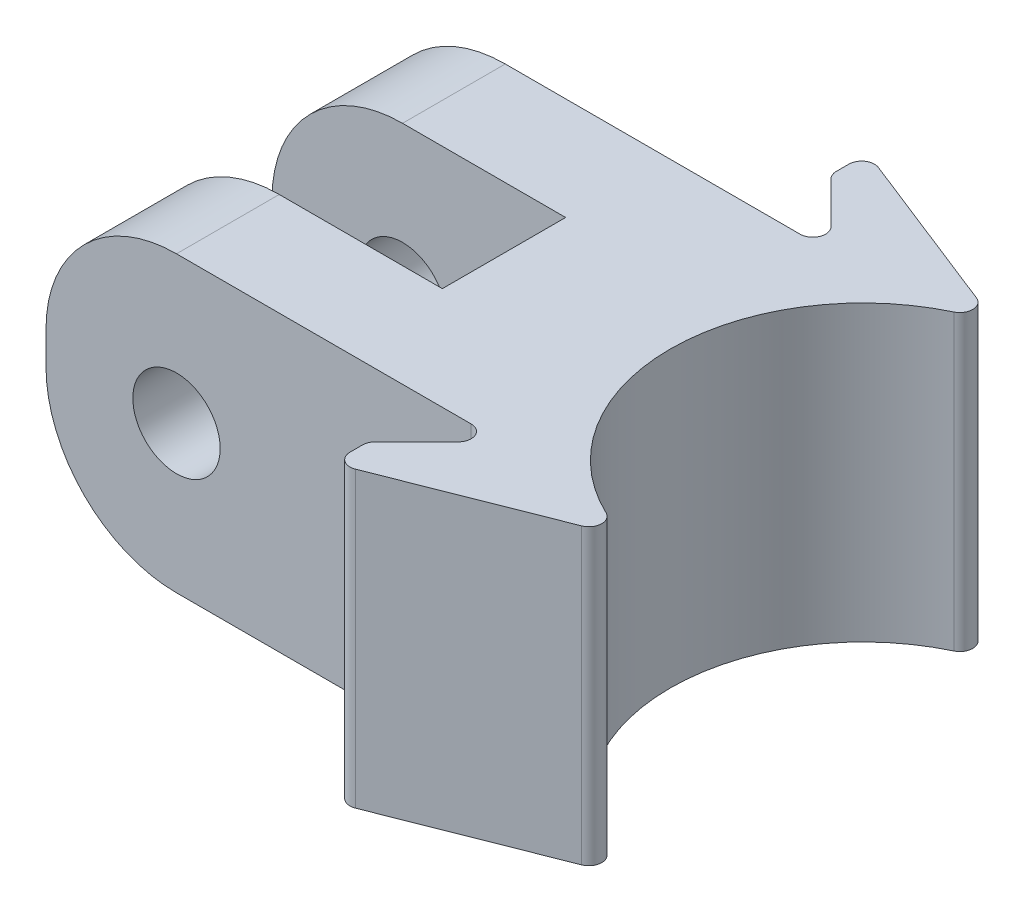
ISO-10303-21;
HEADER;
FILE_DESCRIPTION(('STEP AP214'),'2;1');
FILE_NAME('part.step','',(''),(''),'','','');
FILE_SCHEMA(('AUTOMOTIVE_DESIGN { 1 0 10303 214 1 1 1 1 }'));
ENDSEC;
DATA;
#1=APPLICATION_CONTEXT('core data for automotive mechanical design processes');
#2=APPLICATION_PROTOCOL_DEFINITION('international standard','automotive_design',2000,#1);
#3=PRODUCT_CONTEXT('',#1,'mechanical');
#4=PRODUCT('Part','Part','',(#3));
#5=PRODUCT_RELATED_PRODUCT_CATEGORY('part','',(#4));
#6=PRODUCT_DEFINITION_FORMATION('','',#4);
#7=PRODUCT_DEFINITION_CONTEXT('part definition',#1,'design');
#8=PRODUCT_DEFINITION('design','',#6,#7);
#9=PRODUCT_DEFINITION_SHAPE('','',#8);
#10=(LENGTH_UNIT() NAMED_UNIT(*) SI_UNIT(.MILLI.,.METRE.));
#11=(NAMED_UNIT(*) PLANE_ANGLE_UNIT() SI_UNIT($,.RADIAN.));
#12=(NAMED_UNIT(*) SI_UNIT($,.STERADIAN.) SOLID_ANGLE_UNIT());
#13=UNCERTAINTY_MEASURE_WITH_UNIT(LENGTH_MEASURE(1.E-05),#10,'distance_accuracy_value','');
#14=(GEOMETRIC_REPRESENTATION_CONTEXT(3) GLOBAL_UNCERTAINTY_ASSIGNED_CONTEXT((#13)) GLOBAL_UNIT_ASSIGNED_CONTEXT((#10,
#11,#12)) REPRESENTATION_CONTEXT('',''));
#15=CARTESIAN_POINT('',(0.,0.,0.));
#16=DIRECTION('',(0.,0.,1.));
#17=DIRECTION('',(1.,0.,0.));
#18=AXIS2_PLACEMENT_3D('',#15,#16,#17);
#19=CARTESIAN_POINT('',(-11.43,11.43,-2.4));
#20=DIRECTION('',(1.,0.,0.));
#21=DIRECTION('',(0.,0.,-1.));
#22=AXIS2_PLACEMENT_3D('',#19,#20,#21);
#23=PLANE('',#22);
#24=DIRECTION('',(0.,-1.,0.));
#25=VECTOR('',#24,1.);
#26=CARTESIAN_POINT('',(-11.43,11.43,-6.4));
#27=LINE('',#26,#25);
#28=CARTESIAN_POINT('',(-11.43,6.35,-6.4));
#29=VERTEX_POINT('',#28);
#30=CARTESIAN_POINT('',(-11.43,5.08,-6.4));
#31=VERTEX_POINT('',#30);
#32=EDGE_CURVE('E261',#29,#31,#27,.T.);
#33=ORIENTED_EDGE('',*,*,#32,.T.);
#34=DIRECTION('',(0.,0.,1.));
#35=VECTOR('',#34,1.);
#36=CARTESIAN_POINT('',(-11.43,5.08,-2.4));
#37=LINE('',#36,#35);
#38=CARTESIAN_POINT('',(-11.43,5.08,-2.4));
#39=VERTEX_POINT('',#38);
#40=EDGE_CURVE('E320',#31,#39,#37,.T.);
#41=ORIENTED_EDGE('',*,*,#40,.T.);
#42=DIRECTION('',(0.,-1.,0.));
#43=VECTOR('',#42,1.);
#44=CARTESIAN_POINT('',(-11.43,11.43,-2.4));
#45=LINE('',#44,#43);
#46=CARTESIAN_POINT('',(-11.43,6.35,-2.4));
#47=VERTEX_POINT('',#46);
#48=EDGE_CURVE('E228',#47,#39,#45,.T.);
#49=ORIENTED_EDGE('',*,*,#48,.F.);
#50=DIRECTION('',(0.,0.,1.));
#51=VECTOR('',#50,1.);
#52=CARTESIAN_POINT('',(-11.43,6.35,-2.4));
#53=LINE('',#52,#51);
#54=EDGE_CURVE('E318',#47,#29,#53,.F.);
#55=ORIENTED_EDGE('',*,*,#54,.T.);
#56=EDGE_LOOP('',(#33,#41,#49,#55));
#57=FACE_BOUND('',#56,.T.);
#58=ADVANCED_FACE('F33',(#57),#23,.F.);
#59=CARTESIAN_POINT('',(-11.43,11.43,-2.4));
#60=DIRECTION('',(0.,0.,-1.));
#61=DIRECTION('',(-1.,0.,0.));
#62=AXIS2_PLACEMENT_3D('',#59,#60,#61);
#63=PLANE('',#62);
#64=CARTESIAN_POINT('',(-6.35,5.715,-2.4));
#65=DIRECTION('',(0.,0.,-1.));
#66=DIRECTION('',(-1.,0.,0.));
#67=AXIS2_PLACEMENT_3D('',#64,#65,#66);
#68=CIRCLE('',#67,1.69999999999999);
#69=CARTESIAN_POINT('',(-8.04999999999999,5.715,-2.4));
#70=VERTEX_POINT('',#69);
#71=EDGE_CURVE('E264',#70,#70,#68,.T.);
#72=ORIENTED_EDGE('',*,*,#71,.T.);
#73=EDGE_LOOP('',(#72));
#74=FACE_BOUND('',#73,.T.);
#75=ORIENTED_EDGE('',*,*,#48,.T.);
#76=CARTESIAN_POINT('',(-6.35,5.08,-2.4));
#77=DIRECTION('',(0.,0.,-1.));
#78=DIRECTION('',(-1.,0.,0.));
#79=AXIS2_PLACEMENT_3D('',#76,#77,#78);
#80=CIRCLE('',#79,5.08);
#81=CARTESIAN_POINT('',(-6.35,0.,-2.4));
#82=VERTEX_POINT('',#81);
#83=EDGE_CURVE('E325',#39,#82,#80,.F.);
#84=ORIENTED_EDGE('',*,*,#83,.T.);
#85=DIRECTION('',(1.,0.,0.));
#86=VECTOR('',#85,1.);
#87=CARTESIAN_POINT('',(-11.43,0.,-2.4));
#88=LINE('',#87,#86);
#89=CARTESIAN_POINT('',(0.,0.,-2.4));
#90=VERTEX_POINT('',#89);
#91=EDGE_CURVE('E225',#82,#90,#88,.T.);
#92=ORIENTED_EDGE('',*,*,#91,.T.);
#93=DIRECTION('',(0.,-1.,0.));
#94=VECTOR('',#93,1.);
#95=CARTESIAN_POINT('',(0.,11.43,-2.4));
#96=LINE('',#95,#94);
#97=CARTESIAN_POINT('',(0.,11.43,-2.4));
#98=VERTEX_POINT('',#97);
#99=EDGE_CURVE('E221',#98,#90,#96,.T.);
#100=ORIENTED_EDGE('',*,*,#99,.F.);
#101=DIRECTION('',(1.,0.,0.));
#102=VECTOR('',#101,1.);
#103=CARTESIAN_POINT('',(-11.43,11.43,-2.4));
#104=LINE('',#103,#102);
#105=CARTESIAN_POINT('',(-6.35,11.43,-2.4));
#106=VERTEX_POINT('',#105);
#107=EDGE_CURVE('E207',#106,#98,#104,.T.);
#108=ORIENTED_EDGE('',*,*,#107,.F.);
#109=CARTESIAN_POINT('',(-6.35,6.35,-2.4));
#110=DIRECTION('',(0.,0.,-1.));
#111=DIRECTION('',(-1.,0.,0.));
#112=AXIS2_PLACEMENT_3D('',#109,#110,#111);
#113=CIRCLE('',#112,5.08);
#114=EDGE_CURVE('E323',#106,#47,#113,.F.);
#115=ORIENTED_EDGE('',*,*,#114,.T.);
#116=EDGE_LOOP('',(#75,#84,#92,#100,#108,#115));
#117=FACE_BOUND('',#116,.T.);
#118=ADVANCED_FACE('F223',(#74,#117),#63,.F.);
#119=CARTESIAN_POINT('',(0.,11.43,-2.4));
#120=DIRECTION('',(1.,0.,0.));
#121=DIRECTION('',(0.,0.,-1.));
#122=AXIS2_PLACEMENT_3D('',#119,#120,#121);
#123=PLANE('',#122);
#124=DIRECTION('',(0.,0.,1.));
#125=VECTOR('',#124,1.);
#126=CARTESIAN_POINT('',(0.,0.,-2.4));
#127=LINE('',#126,#125);
#128=CARTESIAN_POINT('',(0.,0.,2.4));
#129=VERTEX_POINT('',#128);
#130=EDGE_CURVE('E263',#90,#129,#127,.T.);
#131=ORIENTED_EDGE('',*,*,#130,.T.);
#132=DIRECTION('',(0.,-1.,0.));
#133=VECTOR('',#132,1.);
#134=CARTESIAN_POINT('',(0.,11.43,2.4));
#135=LINE('',#134,#133);
#136=CARTESIAN_POINT('',(0.,11.43,2.4));
#137=VERTEX_POINT('',#136);
#138=EDGE_CURVE('E229',#137,#129,#135,.T.);
#139=ORIENTED_EDGE('',*,*,#138,.F.);
#140=DIRECTION('',(0.,0.,1.));
#141=VECTOR('',#140,1.);
#142=CARTESIAN_POINT('',(0.,11.43,-2.4));
#143=LINE('',#142,#141);
#144=EDGE_CURVE('E213',#98,#137,#143,.T.);
#145=ORIENTED_EDGE('',*,*,#144,.F.);
#146=ORIENTED_EDGE('',*,*,#99,.T.);
#147=EDGE_LOOP('',(#131,#139,#145,#146));
#148=FACE_BOUND('',#147,.T.);
#149=ADVANCED_FACE('F231',(#148),#123,.F.);
#150=CARTESIAN_POINT('',(0.,11.43,2.4));
#151=DIRECTION('',(0.,0.,1.));
#152=DIRECTION('',(1.,0.,0.));
#153=AXIS2_PLACEMENT_3D('',#150,#151,#152);
#154=PLANE('',#153);
#155=CARTESIAN_POINT('',(-6.35,5.715,2.4));
#156=DIRECTION('',(0.,0.,1.));
#157=DIRECTION('',(1.,0.,0.));
#158=AXIS2_PLACEMENT_3D('',#155,#156,#157);
#159=CIRCLE('',#158,1.69999999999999);
#160=CARTESIAN_POINT('',(-4.65000000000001,5.715,2.4));
#161=VERTEX_POINT('',#160);
#162=EDGE_CURVE('E498',#161,#161,#159,.T.);
#163=ORIENTED_EDGE('',*,*,#162,.T.);
#164=EDGE_LOOP('',(#163));
#165=FACE_BOUND('',#164,.T.);
#166=DIRECTION('',(-1.,0.,0.));
#167=VECTOR('',#166,1.);
#168=CARTESIAN_POINT('',(0.,0.,2.4));
#169=LINE('',#168,#167);
#170=CARTESIAN_POINT('',(-6.35,0.,2.4));
#171=VERTEX_POINT('',#170);
#172=EDGE_CURVE('E266',#129,#171,#169,.T.);
#173=ORIENTED_EDGE('',*,*,#172,.T.);
#174=CARTESIAN_POINT('',(-6.35,5.08,2.4));
#175=DIRECTION('',(0.,0.,1.));
#176=DIRECTION('',(1.,0.,0.));
#177=AXIS2_PLACEMENT_3D('',#174,#175,#176);
#178=CIRCLE('',#177,5.08);
#179=CARTESIAN_POINT('',(-11.43,5.08,2.4));
#180=VERTEX_POINT('',#179);
#181=EDGE_CURVE('E316',#171,#180,#178,.F.);
#182=ORIENTED_EDGE('',*,*,#181,.T.);
#183=DIRECTION('',(0.,-1.,0.));
#184=VECTOR('',#183,1.);
#185=CARTESIAN_POINT('',(-11.43,11.43,2.4));
#186=LINE('',#185,#184);
#187=CARTESIAN_POINT('',(-11.43,6.35,2.4));
#188=VERTEX_POINT('',#187);
#189=EDGE_CURVE('E295',#188,#180,#186,.T.);
#190=ORIENTED_EDGE('',*,*,#189,.F.);
#191=CARTESIAN_POINT('',(-6.35,6.35,2.4));
#192=DIRECTION('',(0.,0.,1.));
#193=DIRECTION('',(1.,0.,0.));
#194=AXIS2_PLACEMENT_3D('',#191,#192,#193);
#195=CIRCLE('',#194,5.08);
#196=CARTESIAN_POINT('',(-6.35,11.43,2.4));
#197=VERTEX_POINT('',#196);
#198=EDGE_CURVE('E314',#188,#197,#195,.F.);
#199=ORIENTED_EDGE('',*,*,#198,.T.);
#200=DIRECTION('',(-1.,0.,0.));
#201=VECTOR('',#200,1.);
#202=CARTESIAN_POINT('',(0.,11.43,2.4));
#203=LINE('',#202,#201);
#204=EDGE_CURVE('E234',#137,#197,#203,.T.);
#205=ORIENTED_EDGE('',*,*,#204,.F.);
#206=ORIENTED_EDGE('',*,*,#138,.T.);
#207=EDGE_LOOP('',(#173,#182,#190,#199,#205,#206));
#208=FACE_BOUND('',#207,.T.);
#209=ADVANCED_FACE('F430',(#165,#208),#154,.F.);
#210=CARTESIAN_POINT('',(-11.43,11.43,6.4));
#211=DIRECTION('',(1.,0.,0.));
#212=DIRECTION('',(0.,0.,-1.));
#213=AXIS2_PLACEMENT_3D('',#210,#211,#212);
#214=PLANE('',#213);
#215=ORIENTED_EDGE('',*,*,#189,.T.);
#216=DIRECTION('',(0.,0.,1.));
#217=VECTOR('',#216,1.);
#218=CARTESIAN_POINT('',(-11.43,5.08,6.4));
#219=LINE('',#218,#217);
#220=CARTESIAN_POINT('',(-11.43,5.08,6.4));
#221=VERTEX_POINT('',#220);
#222=EDGE_CURVE('E302',#180,#221,#219,.T.);
#223=ORIENTED_EDGE('',*,*,#222,.T.);
#224=DIRECTION('',(0.,-1.,0.));
#225=VECTOR('',#224,1.);
#226=CARTESIAN_POINT('',(-11.43,11.43,6.4));
#227=LINE('',#226,#225);
#228=CARTESIAN_POINT('',(-11.43,6.35,6.4));
#229=VERTEX_POINT('',#228);
#230=EDGE_CURVE('E292',#229,#221,#227,.T.);
#231=ORIENTED_EDGE('',*,*,#230,.F.);
#232=DIRECTION('',(0.,0.,1.));
#233=VECTOR('',#232,1.);
#234=CARTESIAN_POINT('',(-11.43,6.35,6.4));
#235=LINE('',#234,#233);
#236=EDGE_CURVE('E300',#229,#188,#235,.F.);
#237=ORIENTED_EDGE('',*,*,#236,.T.);
#238=EDGE_LOOP('',(#215,#223,#231,#237));
#239=FACE_BOUND('',#238,.T.);
#240=ADVANCED_FACE('F443',(#239),#214,.F.);
#241=CARTESIAN_POINT('',(6.32987145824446,11.43,6.4));
#242=DIRECTION('',(0.,0.,-1.));
#243=DIRECTION('',(-1.,0.,0.));
#244=AXIS2_PLACEMENT_3D('',#241,#242,#243);
#245=PLANE('',#244);
#246=CARTESIAN_POINT('',(-6.35,5.715,6.4));
#247=DIRECTION('',(0.,0.,1.));
#248=DIRECTION('',(1.,0.,0.));
#249=AXIS2_PLACEMENT_3D('',#246,#247,#248);
#250=CIRCLE('',#249,1.69999999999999);
#251=CARTESIAN_POINT('',(-4.65000000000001,5.715,6.4));
#252=VERTEX_POINT('',#251);
#253=EDGE_CURVE('E486',#252,#252,#250,.T.);
#254=ORIENTED_EDGE('',*,*,#253,.F.);
#255=EDGE_LOOP('',(#254));
#256=FACE_BOUND('',#255,.T.);
#257=DIRECTION('',(1.,0.,0.));
#258=VECTOR('',#257,1.);
#259=CARTESIAN_POINT('',(6.32987145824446,0.,6.4));
#260=LINE('',#259,#258);
#261=CARTESIAN_POINT('',(-6.35,0.,6.4));
#262=VERTEX_POINT('',#261);
#263=CARTESIAN_POINT('',(5.12276467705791,0.,6.4));
#264=VERTEX_POINT('',#263);
#265=EDGE_CURVE('E269',#262,#264,#260,.T.);
#266=ORIENTED_EDGE('',*,*,#265,.T.);
#267=DIRECTION('',(0.,-1.,0.));
#268=VECTOR('',#267,1.);
#269=CARTESIAN_POINT('',(5.12276467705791,11.43,6.4));
#270=LINE('',#269,#268);
#271=CARTESIAN_POINT('',(5.12276467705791,11.43,6.4));
#272=VERTEX_POINT('',#271);
#273=EDGE_CURVE('E382',#264,#272,#270,.F.);
#274=ORIENTED_EDGE('',*,*,#273,.T.);
#275=DIRECTION('',(1.,0.,0.));
#276=VECTOR('',#275,1.);
#277=CARTESIAN_POINT('',(6.32987145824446,11.43,6.4));
#278=LINE('',#277,#276);
#279=CARTESIAN_POINT('',(-6.35,11.43,6.4));
#280=VERTEX_POINT('',#279);
#281=EDGE_CURVE('E236',#280,#272,#278,.T.);
#282=ORIENTED_EDGE('',*,*,#281,.F.);
#283=CARTESIAN_POINT('',(-6.35,6.35,6.4));
#284=DIRECTION('',(0.,0.,-1.));
#285=DIRECTION('',(-1.,0.,0.));
#286=AXIS2_PLACEMENT_3D('',#283,#284,#285);
#287=CIRCLE('',#286,5.08);
#288=EDGE_CURVE('E305',#280,#229,#287,.F.);
#289=ORIENTED_EDGE('',*,*,#288,.T.);
#290=ORIENTED_EDGE('',*,*,#230,.T.);
#291=CARTESIAN_POINT('',(-6.35,5.08,6.4));
#292=DIRECTION('',(0.,0.,-1.));
#293=DIRECTION('',(-1.,0.,0.));
#294=AXIS2_PLACEMENT_3D('',#291,#292,#293);
#295=CIRCLE('',#294,5.08);
#296=EDGE_CURVE('E307',#221,#262,#295,.F.);
#297=ORIENTED_EDGE('',*,*,#296,.T.);
#298=EDGE_LOOP('',(#266,#274,#282,#289,#290,#297));
#299=FACE_BOUND('',#298,.T.);
#300=ADVANCED_FACE('F441',(#256,#299),#245,.F.);
#301=CARTESIAN_POINT('',(6.32987145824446,11.43,6.4));
#302=DIRECTION('',(0.707106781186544,0.,0.707106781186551));
#303=DIRECTION('',(0.707106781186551,0.,-0.707106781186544));
#304=AXIS2_PLACEMENT_3D('',#301,#302,#303);
#305=PLANE('',#304);
#306=DIRECTION('',(-0.707106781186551,0.,0.707106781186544));
#307=VECTOR('',#306,1.);
#308=CARTESIAN_POINT('',(6.32987145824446,0.,6.4));
#309=LINE('',#308,#307);
#310=CARTESIAN_POINT('',(5.47631806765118,0.,7.25355339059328));
#311=VERTEX_POINT('',#310);
#312=CARTESIAN_POINT('',(3.86124835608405,0.,8.86862310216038));
#313=VERTEX_POINT('',#312);
#314=EDGE_CURVE('E272',#311,#313,#309,.T.);
#315=ORIENTED_EDGE('',*,*,#314,.T.);
#316=DIRECTION('',(0.,-1.,0.));
#317=VECTOR('',#316,1.);
#318=CARTESIAN_POINT('',(3.86124835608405,11.43,8.86862310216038));
#319=LINE('',#318,#317);
#320=CARTESIAN_POINT('',(3.86124835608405,11.43,8.86862310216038));
#321=VERTEX_POINT('',#320);
#322=EDGE_CURVE('E380',#313,#321,#319,.F.);
#323=ORIENTED_EDGE('',*,*,#322,.T.);
#324=DIRECTION('',(-0.707106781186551,0.,0.707106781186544));
#325=VECTOR('',#324,1.);
#326=CARTESIAN_POINT('',(6.32987145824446,11.43,6.4));
#327=LINE('',#326,#325);
#328=CARTESIAN_POINT('',(5.47631806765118,11.43,7.25355339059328));
#329=VERTEX_POINT('',#328);
#330=EDGE_CURVE('E242',#329,#321,#327,.T.);
#331=ORIENTED_EDGE('',*,*,#330,.F.);
#332=DIRECTION('',(0.,-1.,0.));
#333=VECTOR('',#332,1.);
#334=CARTESIAN_POINT('',(5.47631806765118,0.,7.25355339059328));
#335=LINE('',#334,#333);
#336=EDGE_CURVE('E377',#329,#311,#335,.T.);
#337=ORIENTED_EDGE('',*,*,#336,.T.);
#338=EDGE_LOOP('',(#315,#323,#331,#337));
#339=FACE_BOUND('',#338,.T.);
#340=ADVANCED_FACE('F457',(#339),#305,.F.);
#341=CARTESIAN_POINT('',(3.71480174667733,11.43,9.01506971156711));
#342=DIRECTION('',(1.,0.,0.));
#343=DIRECTION('',(0.,0.,-1.));
#344=AXIS2_PLACEMENT_3D('',#341,#342,#343);
#345=PLANE('',#344);
#346=DIRECTION('',(0.,0.,1.));
#347=VECTOR('',#346,1.);
#348=CARTESIAN_POINT('',(3.71480174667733,0.,9.01506971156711));
#349=LINE('',#348,#347);
#350=CARTESIAN_POINT('',(3.71480174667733,0.,9.22217649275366));
#351=VERTEX_POINT('',#350);
#352=CARTESIAN_POINT('',(3.71480174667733,0.,9.70940074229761));
#353=VERTEX_POINT('',#352);
#354=EDGE_CURVE('E275',#351,#353,#349,.T.);
#355=ORIENTED_EDGE('',*,*,#354,.T.);
#356=DIRECTION('',(0.,-1.,0.));
#357=VECTOR('',#356,1.);
#358=CARTESIAN_POINT('',(3.71480174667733,11.43,9.70940074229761));
#359=LINE('',#358,#357);
#360=CARTESIAN_POINT('',(3.71480174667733,11.43,9.70940074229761));
#361=VERTEX_POINT('',#360);
#362=EDGE_CURVE('E375',#353,#361,#359,.F.);
#363=ORIENTED_EDGE('',*,*,#362,.T.);
#364=DIRECTION('',(0.,0.,1.));
#365=VECTOR('',#364,1.);
#366=CARTESIAN_POINT('',(3.71480174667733,11.43,9.01506971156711));
#367=LINE('',#366,#365);
#368=CARTESIAN_POINT('',(3.71480174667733,11.43,9.22217649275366));
#369=VERTEX_POINT('',#368);
#370=EDGE_CURVE('E245',#369,#361,#367,.T.);
#371=ORIENTED_EDGE('',*,*,#370,.F.);
#372=DIRECTION('',(0.,-1.,0.));
#373=VECTOR('',#372,1.);
#374=CARTESIAN_POINT('',(3.71480174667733,11.43,9.22217649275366));
#375=LINE('',#374,#373);
#376=EDGE_CURVE('E372',#369,#351,#375,.T.);
#377=ORIENTED_EDGE('',*,*,#376,.T.);
#378=EDGE_LOOP('',(#355,#363,#371,#377));
#379=FACE_BOUND('',#378,.T.);
#380=ADVANCED_FACE('F466',(#379),#345,.F.);
#381=CARTESIAN_POINT('',(3.71480174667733,11.43,10.4440431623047));
#382=DIRECTION('',(-0.366847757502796,0.,-0.930280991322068));
#383=DIRECTION('',(-0.930280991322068,0.,0.366847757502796));
#384=AXIS2_PLACEMENT_3D('',#381,#382,#383);
#385=PLANE('',#384);
#386=DIRECTION('',(0.930280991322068,0.,-0.366847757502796));
#387=VECTOR('',#386,1.);
#388=CARTESIAN_POINT('',(3.71480174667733,0.,10.4440431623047));
#389=LINE('',#388,#387);
#390=CARTESIAN_POINT('',(4.39822562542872,0.,10.1745412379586));
#391=VERTEX_POINT('',#390);
#392=CARTESIAN_POINT('',(10.7093241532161,0.,7.68581754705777));
#393=VERTEX_POINT('',#392);
#394=EDGE_CURVE('E278',#391,#393,#389,.T.);
#395=ORIENTED_EDGE('',*,*,#394,.T.);
#396=DIRECTION('',(0.,1.,0.));
#397=VECTOR('',#396,1.);
#398=CARTESIAN_POINT('',(10.7093241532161,11.43,7.68581754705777));
#399=LINE('',#398,#397);
#400=CARTESIAN_POINT('',(10.7093241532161,11.43,7.68581754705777));
#401=VERTEX_POINT('',#400);
#402=EDGE_CURVE('E339',#393,#401,#399,.T.);
#403=ORIENTED_EDGE('',*,*,#402,.T.);
#404=DIRECTION('',(0.930280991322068,0.,-0.366847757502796));
#405=VECTOR('',#404,1.);
#406=CARTESIAN_POINT('',(3.71480174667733,11.43,10.4440431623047));
#407=LINE('',#406,#405);
#408=CARTESIAN_POINT('',(4.39822562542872,11.43,10.1745412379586));
#409=VERTEX_POINT('',#408);
#410=EDGE_CURVE('E248',#409,#401,#407,.T.);
#411=ORIENTED_EDGE('',*,*,#410,.F.);
#412=DIRECTION('',(0.,-1.,0.));
#413=VECTOR('',#412,1.);
#414=CARTESIAN_POINT('',(4.39822562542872,11.43,10.1745412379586));
#415=LINE('',#414,#413);
#416=EDGE_CURVE('E336',#409,#391,#415,.T.);
#417=ORIENTED_EDGE('',*,*,#416,.T.);
#418=EDGE_LOOP('',(#395,#403,#411,#417));
#419=FACE_BOUND('',#418,.T.);
#420=ADVANCED_FACE('F475',(#419),#385,.F.);
#421=CARTESIAN_POINT('',(3.71480174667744,11.43,-10.4440431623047));
#422=DIRECTION('',(-0.366847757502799,0.,0.930280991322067));
#423=DIRECTION('',(0.930280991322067,0.,0.366847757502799));
#424=AXIS2_PLACEMENT_3D('',#421,#422,#423);
#425=PLANE('',#424);
#426=DIRECTION('',(-0.930280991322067,0.,-0.366847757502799));
#427=VECTOR('',#426,1.);
#428=CARTESIAN_POINT('',(3.71480174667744,11.43,-10.4440431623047));
#429=LINE('',#428,#427);
#430=CARTESIAN_POINT('',(10.7093241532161,11.43,-7.68581754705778));
#431=VERTEX_POINT('',#430);
#432=CARTESIAN_POINT('',(4.39822562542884,11.43,-10.1745412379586));
#433=VERTEX_POINT('',#432);
#434=EDGE_CURVE('E250',#431,#433,#429,.T.);
#435=ORIENTED_EDGE('',*,*,#434,.F.);
#436=DIRECTION('',(0.,1.,0.));
#437=VECTOR('',#436,1.);
#438=CARTESIAN_POINT('',(10.7093241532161,11.43,-7.68581754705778));
#439=LINE('',#438,#437);
#440=CARTESIAN_POINT('',(10.7093241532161,0.,-7.68581754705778));
#441=VERTEX_POINT('',#440);
#442=EDGE_CURVE('E370',#431,#441,#439,.F.);
#443=ORIENTED_EDGE('',*,*,#442,.T.);
#444=DIRECTION('',(-0.930280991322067,0.,-0.366847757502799));
#445=VECTOR('',#444,1.);
#446=CARTESIAN_POINT('',(3.71480174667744,0.,-10.4440431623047));
#447=LINE('',#446,#445);
#448=CARTESIAN_POINT('',(4.39822562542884,0.,-10.1745412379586));
#449=VERTEX_POINT('',#448);
#450=EDGE_CURVE('E281',#441,#449,#447,.T.);
#451=ORIENTED_EDGE('',*,*,#450,.T.);
#452=DIRECTION('',(0.,-1.,0.));
#453=VECTOR('',#452,1.);
#454=CARTESIAN_POINT('',(4.39822562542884,11.43,-10.1745412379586));
#455=LINE('',#454,#453);
#456=EDGE_CURVE('E368',#449,#433,#455,.F.);
#457=ORIENTED_EDGE('',*,*,#456,.T.);
#458=EDGE_LOOP('',(#435,#443,#451,#457));
#459=FACE_BOUND('',#458,.T.);
#460=ADVANCED_FACE('F562',(#459),#425,.F.);
#461=CARTESIAN_POINT('',(3.71480174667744,11.43,-9.01506971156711));
#462=DIRECTION('',(1.,0.,0.));
#463=DIRECTION('',(0.,0.,-1.));
#464=AXIS2_PLACEMENT_3D('',#461,#462,#463);
#465=PLANE('',#464);
#466=DIRECTION('',(0.,0.,1.));
#467=VECTOR('',#466,1.);
#468=CARTESIAN_POINT('',(3.71480174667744,0.,-9.01506971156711));
#469=LINE('',#468,#467);
#470=CARTESIAN_POINT('',(3.71480174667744,0.,-9.70940074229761));
#471=VERTEX_POINT('',#470);
#472=CARTESIAN_POINT('',(3.71480174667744,0.,-9.22217649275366));
#473=VERTEX_POINT('',#472);
#474=EDGE_CURVE('E283',#471,#473,#469,.T.);
#475=ORIENTED_EDGE('',*,*,#474,.T.);
#476=DIRECTION('',(0.,-1.,0.));
#477=VECTOR('',#476,1.);
#478=CARTESIAN_POINT('',(3.71480174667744,11.43,-9.22217649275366));
#479=LINE('',#478,#477);
#480=CARTESIAN_POINT('',(3.71480174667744,11.43,-9.22217649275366));
#481=VERTEX_POINT('',#480);
#482=EDGE_CURVE('E395',#473,#481,#479,.F.);
#483=ORIENTED_EDGE('',*,*,#482,.T.);
#484=DIRECTION('',(0.,0.,1.));
#485=VECTOR('',#484,1.);
#486=CARTESIAN_POINT('',(3.71480174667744,11.43,-9.01506971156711));
#487=LINE('',#486,#485);
#488=CARTESIAN_POINT('',(3.71480174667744,11.43,-9.70940074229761));
#489=VERTEX_POINT('',#488);
#490=EDGE_CURVE('E253',#489,#481,#487,.T.);
#491=ORIENTED_EDGE('',*,*,#490,.F.);
#492=DIRECTION('',(0.,-1.,0.));
#493=VECTOR('',#492,1.);
#494=CARTESIAN_POINT('',(3.71480174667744,11.43,-9.70940074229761));
#495=LINE('',#494,#493);
#496=EDGE_CURVE('E392',#489,#471,#495,.T.);
#497=ORIENTED_EDGE('',*,*,#496,.T.);
#498=EDGE_LOOP('',(#475,#483,#491,#497));
#499=FACE_BOUND('',#498,.T.);
#500=ADVANCED_FACE('F558',(#499),#465,.F.);
#501=CARTESIAN_POINT('',(6.32987145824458,11.43,-6.4));
#502=DIRECTION('',(0.707106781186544,0.,-0.707106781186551));
#503=DIRECTION('',(-0.707106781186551,0.,-0.707106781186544));
#504=AXIS2_PLACEMENT_3D('',#501,#502,#503);
#505=PLANE('',#504);
#506=DIRECTION('',(0.707106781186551,0.,0.707106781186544));
#507=VECTOR('',#506,1.);
#508=CARTESIAN_POINT('',(6.32987145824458,0.,-6.4));
#509=LINE('',#508,#507);
#510=CARTESIAN_POINT('',(3.86124835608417,0.,-8.86862310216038));
#511=VERTEX_POINT('',#510);
#512=CARTESIAN_POINT('',(5.47631806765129,0.,-7.25355339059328));
#513=VERTEX_POINT('',#512);
#514=EDGE_CURVE('E286',#511,#513,#509,.T.);
#515=ORIENTED_EDGE('',*,*,#514,.T.);
#516=DIRECTION('',(0.,-1.,0.));
#517=VECTOR('',#516,1.);
#518=CARTESIAN_POINT('',(5.47631806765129,11.43,-7.25355339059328));
#519=LINE('',#518,#517);
#520=CARTESIAN_POINT('',(5.47631806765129,11.43,-7.25355339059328));
#521=VERTEX_POINT('',#520);
#522=EDGE_CURVE('E390',#513,#521,#519,.F.);
#523=ORIENTED_EDGE('',*,*,#522,.T.);
#524=DIRECTION('',(0.707106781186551,0.,0.707106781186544));
#525=VECTOR('',#524,1.);
#526=CARTESIAN_POINT('',(6.32987145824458,11.43,-6.4));
#527=LINE('',#526,#525);
#528=CARTESIAN_POINT('',(3.86124835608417,11.43,-8.86862310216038));
#529=VERTEX_POINT('',#528);
#530=EDGE_CURVE('E256',#529,#521,#527,.T.);
#531=ORIENTED_EDGE('',*,*,#530,.F.);
#532=DIRECTION('',(0.,-1.,0.));
#533=VECTOR('',#532,1.);
#534=CARTESIAN_POINT('',(3.86124835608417,11.43,-8.86862310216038));
#535=LINE('',#534,#533);
#536=EDGE_CURVE('E387',#529,#511,#535,.T.);
#537=ORIENTED_EDGE('',*,*,#536,.T.);
#538=EDGE_LOOP('',(#515,#523,#531,#537));
#539=FACE_BOUND('',#538,.T.);
#540=ADVANCED_FACE('F408',(#539),#505,.F.);
#541=CARTESIAN_POINT('',(-11.43,11.43,-6.4));
#542=DIRECTION('',(0.,0.,1.));
#543=DIRECTION('',(1.,0.,0.));
#544=AXIS2_PLACEMENT_3D('',#541,#542,#543);
#545=PLANE('',#544);
#546=CARTESIAN_POINT('',(-6.35,5.715,-6.4));
#547=DIRECTION('',(0.,0.,1.));
#548=DIRECTION('',(1.,0.,0.));
#549=AXIS2_PLACEMENT_3D('',#546,#547,#548);
#550=CIRCLE('',#549,1.69999999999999);
#551=CARTESIAN_POINT('',(-4.65000000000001,5.715,-6.4));
#552=VERTEX_POINT('',#551);
#553=EDGE_CURVE('E495',#552,#552,#550,.T.);
#554=ORIENTED_EDGE('',*,*,#553,.T.);
#555=EDGE_LOOP('',(#554));
#556=FACE_BOUND('',#555,.T.);
#557=DIRECTION('',(-1.,0.,0.));
#558=VECTOR('',#557,1.);
#559=CARTESIAN_POINT('',(-11.43,11.43,-6.4));
#560=LINE('',#559,#558);
#561=CARTESIAN_POINT('',(5.12276467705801,11.43,-6.4));
#562=VERTEX_POINT('',#561);
#563=CARTESIAN_POINT('',(-6.35,11.43,-6.4));
#564=VERTEX_POINT('',#563);
#565=EDGE_CURVE('E259',#562,#564,#560,.T.);
#566=ORIENTED_EDGE('',*,*,#565,.F.);
#567=DIRECTION('',(0.,-1.,0.));
#568=VECTOR('',#567,1.);
#569=CARTESIAN_POINT('',(5.12276467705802,0.,-6.4));
#570=LINE('',#569,#568);
#571=CARTESIAN_POINT('',(5.12276467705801,0.,-6.4));
#572=VERTEX_POINT('',#571);
#573=EDGE_CURVE('E384',#562,#572,#570,.T.);
#574=ORIENTED_EDGE('',*,*,#573,.T.);
#575=DIRECTION('',(-1.,0.,0.));
#576=VECTOR('',#575,1.);
#577=CARTESIAN_POINT('',(-11.43,0.,-6.4));
#578=LINE('',#577,#576);
#579=CARTESIAN_POINT('',(-6.35,0.,-6.4));
#580=VERTEX_POINT('',#579);
#581=EDGE_CURVE('E218',#572,#580,#578,.T.);
#582=ORIENTED_EDGE('',*,*,#581,.T.);
#583=CARTESIAN_POINT('',(-6.35,5.08,-6.4));
#584=DIRECTION('',(0.,0.,1.));
#585=DIRECTION('',(1.,0.,0.));
#586=AXIS2_PLACEMENT_3D('',#583,#584,#585);
#587=CIRCLE('',#586,5.08);
#588=EDGE_CURVE('E330',#580,#31,#587,.F.);
#589=ORIENTED_EDGE('',*,*,#588,.T.);
#590=ORIENTED_EDGE('',*,*,#32,.F.);
#591=CARTESIAN_POINT('',(-6.35,6.35,-6.4));
#592=DIRECTION('',(0.,0.,1.));
#593=DIRECTION('',(1.,0.,0.));
#594=AXIS2_PLACEMENT_3D('',#591,#592,#593);
#595=CIRCLE('',#594,5.08);
#596=EDGE_CURVE('E327',#29,#564,#595,.F.);
#597=ORIENTED_EDGE('',*,*,#596,.T.);
#598=EDGE_LOOP('',(#566,#574,#582,#589,#590,#597));
#599=FACE_BOUND('',#598,.T.);
#600=ADVANCED_FACE('F415',(#556,#599),#545,.F.);
#601=CARTESIAN_POINT('',(0.,11.43,0.));
#602=DIRECTION('',(0.,-1.,0.));
#603=DIRECTION('',(0.,0.,-1.));
#604=AXIS2_PLACEMENT_3D('',#601,#602,#603);
#605=PLANE('',#604);
#606=ORIENTED_EDGE('',*,*,#410,.T.);
#607=CARTESIAN_POINT('',(10.5259002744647,11.43,7.22067705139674));
#608=DIRECTION('',(0.,-1.,0.));
#609=DIRECTION('',(0.,0.,-1.));
#610=AXIS2_PLACEMENT_3D('',#607,#608,#609);
#611=CIRCLE('',#610,0.5);
#612=CARTESIAN_POINT('',(10.7411565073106,11.43,6.76938473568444));
#613=VERTEX_POINT('',#612);
#614=EDGE_CURVE('E352',#401,#613,#611,.F.);
#615=ORIENTED_EDGE('',*,*,#614,.T.);
#616=CARTESIAN_POINT('',(13.97,11.43,0.));
#617=DIRECTION('',(0.,-1.,0.));
#618=DIRECTION('',(0.,0.,-1.));
#619=AXIS2_PLACEMENT_3D('',#616,#617,#618);
#620=CIRCLE('',#619,7.5);
#621=CARTESIAN_POINT('',(10.7411565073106,11.43,-6.76938473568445));
#622=VERTEX_POINT('',#621);
#623=EDGE_CURVE('E479',#613,#622,#620,.T.);
#624=ORIENTED_EDGE('',*,*,#623,.T.);
#625=CARTESIAN_POINT('',(10.5259002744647,11.43,-7.22067705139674));
#626=DIRECTION('',(0.,-1.,0.));
#627=DIRECTION('',(0.,0.,-1.));
#628=AXIS2_PLACEMENT_3D('',#625,#626,#627);
#629=CIRCLE('',#628,0.5);
#630=EDGE_CURVE('E350',#622,#431,#629,.F.);
#631=ORIENTED_EDGE('',*,*,#630,.T.);
#632=ORIENTED_EDGE('',*,*,#434,.T.);
#633=CARTESIAN_POINT('',(4.21480174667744,11.43,-9.70940074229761));
#634=DIRECTION('',(0.,-1.,0.));
#635=DIRECTION('',(0.,0.,-1.));
#636=AXIS2_PLACEMENT_3D('',#633,#634,#635);
#637=CIRCLE('',#636,0.5);
#638=EDGE_CURVE('E342',#433,#489,#637,.F.);
#639=ORIENTED_EDGE('',*,*,#638,.T.);
#640=ORIENTED_EDGE('',*,*,#490,.T.);
#641=CARTESIAN_POINT('',(4.21480174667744,11.43,-9.22217649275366));
#642=DIRECTION('',(0.,-1.,0.));
#643=DIRECTION('',(0.,0.,-1.));
#644=AXIS2_PLACEMENT_3D('',#641,#642,#643);
#645=CIRCLE('',#644,0.5);
#646=EDGE_CURVE('E344',#481,#529,#645,.F.);
#647=ORIENTED_EDGE('',*,*,#646,.T.);
#648=ORIENTED_EDGE('',*,*,#530,.T.);
#649=CARTESIAN_POINT('',(5.12276467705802,11.43,-6.9));
#650=DIRECTION('',(0.,-1.,0.));
#651=DIRECTION('',(0.,0.,-1.));
#652=AXIS2_PLACEMENT_3D('',#649,#650,#651);
#653=CIRCLE('',#652,0.5);
#654=EDGE_CURVE('E11',#521,#562,#653,.T.);
#655=ORIENTED_EDGE('',*,*,#654,.T.);
#656=ORIENTED_EDGE('',*,*,#565,.T.);
#657=DIRECTION('',(0.,0.,1.));
#658=VECTOR('',#657,1.);
#659=CARTESIAN_POINT('',(-6.35,11.43,0.));
#660=LINE('',#659,#658);
#661=EDGE_CURVE('E216',#564,#106,#660,.T.);
#662=ORIENTED_EDGE('',*,*,#661,.T.);
#663=ORIENTED_EDGE('',*,*,#107,.T.);
#664=ORIENTED_EDGE('',*,*,#144,.T.);
#665=ORIENTED_EDGE('',*,*,#204,.T.);
#666=DIRECTION('',(0.,0.,1.));
#667=VECTOR('',#666,1.);
#668=CARTESIAN_POINT('',(-6.35,11.43,0.));
#669=LINE('',#668,#667);
#670=EDGE_CURVE('E333',#197,#280,#669,.T.);
#671=ORIENTED_EDGE('',*,*,#670,.T.);
#672=ORIENTED_EDGE('',*,*,#281,.T.);
#673=CARTESIAN_POINT('',(5.12276467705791,11.43,6.9));
#674=DIRECTION('',(0.,-1.,0.));
#675=DIRECTION('',(0.,0.,-1.));
#676=AXIS2_PLACEMENT_3D('',#673,#674,#675);
#677=CIRCLE('',#676,0.5);
#678=EDGE_CURVE('E399',#272,#329,#677,.T.);
#679=ORIENTED_EDGE('',*,*,#678,.T.);
#680=ORIENTED_EDGE('',*,*,#330,.T.);
#681=CARTESIAN_POINT('',(4.21480174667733,11.43,9.22217649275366));
#682=DIRECTION('',(0.,-1.,0.));
#683=DIRECTION('',(0.,0.,-1.));
#684=AXIS2_PLACEMENT_3D('',#681,#682,#683);
#685=CIRCLE('',#684,0.5);
#686=EDGE_CURVE('E346',#321,#369,#685,.F.);
#687=ORIENTED_EDGE('',*,*,#686,.T.);
#688=ORIENTED_EDGE('',*,*,#370,.T.);
#689=CARTESIAN_POINT('',(4.21480174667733,11.43,9.70940074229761));
#690=DIRECTION('',(0.,-1.,0.));
#691=DIRECTION('',(0.,0.,-1.));
#692=AXIS2_PLACEMENT_3D('',#689,#690,#691);
#693=CIRCLE('',#692,0.5);
#694=EDGE_CURVE('E348',#361,#409,#693,.F.);
#695=ORIENTED_EDGE('',*,*,#694,.T.);
#696=EDGE_LOOP('',(#606,#615,#624,#631,#632,#639,#640,#647,#648,#655,#656,#662,#663,#664,#665,
#671,#672,#679,#680,#687,#688,#695));
#697=FACE_BOUND('',#696,.T.);
#698=ADVANCED_FACE('F210',(#697),#605,.F.);
#699=CARTESIAN_POINT('',(0.,0.,0.));
#700=DIRECTION('',(0.,-1.,0.));
#701=DIRECTION('',(0.,0.,-1.));
#702=AXIS2_PLACEMENT_3D('',#699,#700,#701);
#703=PLANE('',#702);
#704=CARTESIAN_POINT('',(13.97,0.,0.));
#705=DIRECTION('',(0.,1.,0.));
#706=DIRECTION('',(0.,0.,1.));
#707=AXIS2_PLACEMENT_3D('',#704,#705,#706);
#708=CIRCLE('',#707,7.5);
#709=CARTESIAN_POINT('',(10.7411565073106,0.,-6.76938473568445));
#710=VERTEX_POINT('',#709);
#711=CARTESIAN_POINT('',(10.7411565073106,0.,6.76938473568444));
#712=VERTEX_POINT('',#711);
#713=EDGE_CURVE('E487',#710,#712,#708,.T.);
#714=ORIENTED_EDGE('',*,*,#713,.T.);
#715=CARTESIAN_POINT('',(10.5259002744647,0.,7.22067705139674));
#716=DIRECTION('',(0.,-1.,0.));
#717=DIRECTION('',(0.,0.,-1.));
#718=AXIS2_PLACEMENT_3D('',#715,#716,#717);
#719=CIRCLE('',#718,0.5);
#720=EDGE_CURVE('E366',#712,#393,#719,.T.);
#721=ORIENTED_EDGE('',*,*,#720,.T.);
#722=ORIENTED_EDGE('',*,*,#394,.F.);
#723=CARTESIAN_POINT('',(4.21480174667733,0.,9.70940074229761));
#724=DIRECTION('',(0.,-1.,0.));
#725=DIRECTION('',(0.,0.,-1.));
#726=AXIS2_PLACEMENT_3D('',#723,#724,#725);
#727=CIRCLE('',#726,0.5);
#728=EDGE_CURVE('E363',#391,#353,#727,.T.);
#729=ORIENTED_EDGE('',*,*,#728,.T.);
#730=ORIENTED_EDGE('',*,*,#354,.F.);
#731=CARTESIAN_POINT('',(4.21480174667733,0.,9.22217649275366));
#732=DIRECTION('',(0.,-1.,0.));
#733=DIRECTION('',(0.,0.,-1.));
#734=AXIS2_PLACEMENT_3D('',#731,#732,#733);
#735=CIRCLE('',#734,0.5);
#736=EDGE_CURVE('E361',#351,#313,#735,.T.);
#737=ORIENTED_EDGE('',*,*,#736,.T.);
#738=ORIENTED_EDGE('',*,*,#314,.F.);
#739=CARTESIAN_POINT('',(5.12276467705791,0.,6.9));
#740=DIRECTION('',(0.,-1.,0.));
#741=DIRECTION('',(0.,0.,-1.));
#742=AXIS2_PLACEMENT_3D('',#739,#740,#741);
#743=CIRCLE('',#742,0.5);
#744=EDGE_CURVE('E397',#311,#264,#743,.F.);
#745=ORIENTED_EDGE('',*,*,#744,.T.);
#746=ORIENTED_EDGE('',*,*,#265,.F.);
#747=DIRECTION('',(0.,0.,1.));
#748=VECTOR('',#747,1.);
#749=CARTESIAN_POINT('',(-6.35,0.,2.4));
#750=LINE('',#749,#748);
#751=EDGE_CURVE('E312',#262,#171,#750,.F.);
#752=ORIENTED_EDGE('',*,*,#751,.T.);
#753=ORIENTED_EDGE('',*,*,#172,.F.);
#754=ORIENTED_EDGE('',*,*,#130,.F.);
#755=ORIENTED_EDGE('',*,*,#91,.F.);
#756=DIRECTION('',(0.,0.,1.));
#757=VECTOR('',#756,1.);
#758=CARTESIAN_POINT('',(-6.35,0.,-6.4));
#759=LINE('',#758,#757);
#760=EDGE_CURVE('E309',#82,#580,#759,.F.);
#761=ORIENTED_EDGE('',*,*,#760,.T.);
#762=ORIENTED_EDGE('',*,*,#581,.F.);
#763=CARTESIAN_POINT('',(5.12276467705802,0.,-6.9));
#764=DIRECTION('',(0.,-1.,0.));
#765=DIRECTION('',(0.,0.,-1.));
#766=AXIS2_PLACEMENT_3D('',#763,#764,#765);
#767=CIRCLE('',#766,0.5);
#768=EDGE_CURVE('E41',#572,#513,#767,.F.);
#769=ORIENTED_EDGE('',*,*,#768,.T.);
#770=ORIENTED_EDGE('',*,*,#514,.F.);
#771=CARTESIAN_POINT('',(4.21480174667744,0.,-9.22217649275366));
#772=DIRECTION('',(0.,-1.,0.));
#773=DIRECTION('',(0.,0.,-1.));
#774=AXIS2_PLACEMENT_3D('',#771,#772,#773);
#775=CIRCLE('',#774,0.5);
#776=EDGE_CURVE('E359',#511,#473,#775,.T.);
#777=ORIENTED_EDGE('',*,*,#776,.T.);
#778=ORIENTED_EDGE('',*,*,#474,.F.);
#779=CARTESIAN_POINT('',(4.21480174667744,0.,-9.70940074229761));
#780=DIRECTION('',(0.,-1.,0.));
#781=DIRECTION('',(0.,0.,-1.));
#782=AXIS2_PLACEMENT_3D('',#779,#780,#781);
#783=CIRCLE('',#782,0.5);
#784=EDGE_CURVE('E48',#471,#449,#783,.T.);
#785=ORIENTED_EDGE('',*,*,#784,.T.);
#786=ORIENTED_EDGE('',*,*,#450,.F.);
#787=CARTESIAN_POINT('',(10.5259002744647,0.,-7.22067705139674));
#788=DIRECTION('',(0.,-1.,0.));
#789=DIRECTION('',(0.,0.,-1.));
#790=AXIS2_PLACEMENT_3D('',#787,#788,#789);
#791=CIRCLE('',#790,0.5);
#792=EDGE_CURVE('E56',#441,#710,#791,.T.);
#793=ORIENTED_EDGE('',*,*,#792,.T.);
#794=EDGE_LOOP('',(#714,#721,#722,#729,#730,#737,#738,#745,#746,#752,#753,#754,#755,#761,#762,
#769,#770,#777,#778,#785,#786,#793));
#795=FACE_BOUND('',#794,.T.);
#796=ADVANCED_FACE('F403',(#795),#703,.T.);
#797=CARTESIAN_POINT('',(-6.35,5.08,6.4));
#798=DIRECTION('',(0.,0.,-1.));
#799=DIRECTION('',(-1.,0.,0.));
#800=AXIS2_PLACEMENT_3D('',#797,#798,#799);
#801=CYLINDRICAL_SURFACE('',#800,5.08);
#802=ORIENTED_EDGE('',*,*,#181,.F.);
#803=ORIENTED_EDGE('',*,*,#751,.F.);
#804=ORIENTED_EDGE('',*,*,#296,.F.);
#805=ORIENTED_EDGE('',*,*,#222,.F.);
#806=EDGE_LOOP('',(#802,#803,#804,#805));
#807=FACE_BOUND('',#806,.T.);
#808=ADVANCED_FACE('F446',(#807),#801,.T.);
#809=CARTESIAN_POINT('',(-6.35,5.08,-2.4));
#810=DIRECTION('',(0.,0.,-1.));
#811=DIRECTION('',(-1.,0.,0.));
#812=AXIS2_PLACEMENT_3D('',#809,#810,#811);
#813=CYLINDRICAL_SURFACE('',#812,5.08);
#814=ORIENTED_EDGE('',*,*,#588,.F.);
#815=ORIENTED_EDGE('',*,*,#760,.F.);
#816=ORIENTED_EDGE('',*,*,#83,.F.);
#817=ORIENTED_EDGE('',*,*,#40,.F.);
#818=EDGE_LOOP('',(#814,#815,#816,#817));
#819=FACE_BOUND('',#818,.T.);
#820=ADVANCED_FACE('F426',(#819),#813,.T.);
#821=CARTESIAN_POINT('',(-6.35,6.35,0.));
#822=DIRECTION('',(0.,0.,1.));
#823=DIRECTION('',(1.,0.,0.));
#824=AXIS2_PLACEMENT_3D('',#821,#822,#823);
#825=CYLINDRICAL_SURFACE('',#824,5.08);
#826=ORIENTED_EDGE('',*,*,#198,.F.);
#827=ORIENTED_EDGE('',*,*,#236,.F.);
#828=ORIENTED_EDGE('',*,*,#288,.F.);
#829=ORIENTED_EDGE('',*,*,#670,.F.);
#830=EDGE_LOOP('',(#826,#827,#828,#829));
#831=FACE_BOUND('',#830,.T.);
#832=ADVANCED_FACE('F437',(#831),#825,.T.);
#833=CARTESIAN_POINT('',(-6.35,6.35,0.));
#834=DIRECTION('',(0.,0.,1.));
#835=DIRECTION('',(1.,0.,0.));
#836=AXIS2_PLACEMENT_3D('',#833,#834,#835);
#837=CYLINDRICAL_SURFACE('',#836,5.08);
#838=ORIENTED_EDGE('',*,*,#596,.F.);
#839=ORIENTED_EDGE('',*,*,#54,.F.);
#840=ORIENTED_EDGE('',*,*,#114,.F.);
#841=ORIENTED_EDGE('',*,*,#661,.F.);
#842=EDGE_LOOP('',(#838,#839,#840,#841));
#843=FACE_BOUND('',#842,.T.);
#844=ADVANCED_FACE('F420',(#843),#837,.T.);
#845=CARTESIAN_POINT('',(-6.35,5.715,6.4));
#846=DIRECTION('',(0.,0.,1.));
#847=DIRECTION('',(1.,0.,0.));
#848=AXIS2_PLACEMENT_3D('',#845,#846,#847);
#849=CYLINDRICAL_SURFACE('',#848,1.69999999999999);
#850=ORIENTED_EDGE('',*,*,#253,.T.);
#851=EDGE_LOOP('',(#850));
#852=FACE_BOUND('',#851,.T.);
#853=ORIENTED_EDGE('',*,*,#162,.F.);
#854=EDGE_LOOP('',(#853));
#855=FACE_BOUND('',#854,.T.);
#856=ADVANCED_FACE('F506',(#852,#855),#849,.F.);
#857=ORIENTED_EDGE('',*,*,#553,.F.);
#858=EDGE_LOOP('',(#857));
#859=FACE_BOUND('',#858,.T.);
#860=ORIENTED_EDGE('',*,*,#71,.F.);
#861=EDGE_LOOP('',(#860));
#862=FACE_BOUND('',#861,.T.);
#863=ADVANCED_FACE('F504',(#859,#862),#849,.F.);
#864=CARTESIAN_POINT('',(13.97,0.,0.));
#865=DIRECTION('',(0.,1.,0.));
#866=DIRECTION('',(0.,0.,1.));
#867=AXIS2_PLACEMENT_3D('',#864,#865,#866);
#868=CYLINDRICAL_SURFACE('',#867,7.5);
#869=ORIENTED_EDGE('',*,*,#623,.F.);
#870=DIRECTION('',(0.,1.,0.));
#871=VECTOR('',#870,1.);
#872=CARTESIAN_POINT('',(10.7411565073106,0.,6.76938473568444));
#873=LINE('',#872,#871);
#874=EDGE_CURVE('E356',#613,#712,#873,.F.);
#875=ORIENTED_EDGE('',*,*,#874,.T.);
#876=ORIENTED_EDGE('',*,*,#713,.F.);
#877=DIRECTION('',(0.,1.,0.));
#878=VECTOR('',#877,1.);
#879=CARTESIAN_POINT('',(10.7411565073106,0.,-6.76938473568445));
#880=LINE('',#879,#878);
#881=EDGE_CURVE('E354',#710,#622,#880,.T.);
#882=ORIENTED_EDGE('',*,*,#881,.T.);
#883=EDGE_LOOP('',(#869,#875,#876,#882));
#884=FACE_BOUND('',#883,.T.);
#885=ADVANCED_FACE('F484',(#884),#868,.F.);
#886=CARTESIAN_POINT('',(10.5259002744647,0.,7.22067705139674));
#887=DIRECTION('',(0.,1.,0.));
#888=DIRECTION('',(0.,0.,1.));
#889=AXIS2_PLACEMENT_3D('',#886,#887,#888);
#890=CYLINDRICAL_SURFACE('',#889,0.5);
#891=ORIENTED_EDGE('',*,*,#720,.F.);
#892=ORIENTED_EDGE('',*,*,#874,.F.);
#893=ORIENTED_EDGE('',*,*,#614,.F.);
#894=ORIENTED_EDGE('',*,*,#402,.F.);
#895=EDGE_LOOP('',(#891,#892,#893,#894));
#896=FACE_BOUND('',#895,.T.);
#897=ADVANCED_FACE('F490',(#896),#890,.T.);
#898=CARTESIAN_POINT('',(10.5259002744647,0.,-7.22067705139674));
#899=DIRECTION('',(0.,1.,0.));
#900=DIRECTION('',(0.,0.,1.));
#901=AXIS2_PLACEMENT_3D('',#898,#899,#900);
#902=CYLINDRICAL_SURFACE('',#901,0.5);
#903=ORIENTED_EDGE('',*,*,#630,.F.);
#904=ORIENTED_EDGE('',*,*,#881,.F.);
#905=ORIENTED_EDGE('',*,*,#792,.F.);
#906=ORIENTED_EDGE('',*,*,#442,.F.);
#907=EDGE_LOOP('',(#903,#904,#905,#906));
#908=FACE_BOUND('',#907,.T.);
#909=ADVANCED_FACE('F535',(#908),#902,.T.);
#910=CARTESIAN_POINT('',(4.21480174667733,11.43,9.70940074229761));
#911=DIRECTION('',(0.,-1.,0.));
#912=DIRECTION('',(0.,0.,-1.));
#913=AXIS2_PLACEMENT_3D('',#910,#911,#912);
#914=CYLINDRICAL_SURFACE('',#913,0.5);
#915=ORIENTED_EDGE('',*,*,#694,.F.);
#916=ORIENTED_EDGE('',*,*,#362,.F.);
#917=ORIENTED_EDGE('',*,*,#728,.F.);
#918=ORIENTED_EDGE('',*,*,#416,.F.);
#919=EDGE_LOOP('',(#915,#916,#917,#918));
#920=FACE_BOUND('',#919,.T.);
#921=ADVANCED_FACE('F472',(#920),#914,.T.);
#922=CARTESIAN_POINT('',(4.21480174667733,11.43,9.22217649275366));
#923=DIRECTION('',(0.,-1.,0.));
#924=DIRECTION('',(0.,0.,-1.));
#925=AXIS2_PLACEMENT_3D('',#922,#923,#924);
#926=CYLINDRICAL_SURFACE('',#925,0.5);
#927=ORIENTED_EDGE('',*,*,#686,.F.);
#928=ORIENTED_EDGE('',*,*,#322,.F.);
#929=ORIENTED_EDGE('',*,*,#736,.F.);
#930=ORIENTED_EDGE('',*,*,#376,.F.);
#931=EDGE_LOOP('',(#927,#928,#929,#930));
#932=FACE_BOUND('',#931,.T.);
#933=ADVANCED_FACE('F463',(#932),#926,.T.);
#934=CARTESIAN_POINT('',(5.12276467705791,11.43,6.9));
#935=DIRECTION('',(0.,1.,0.));
#936=DIRECTION('',(0.,0.,1.));
#937=AXIS2_PLACEMENT_3D('',#934,#935,#936);
#938=CYLINDRICAL_SURFACE('',#937,0.5);
#939=ORIENTED_EDGE('',*,*,#678,.F.);
#940=ORIENTED_EDGE('',*,*,#273,.F.);
#941=ORIENTED_EDGE('',*,*,#744,.F.);
#942=ORIENTED_EDGE('',*,*,#336,.F.);
#943=EDGE_LOOP('',(#939,#940,#941,#942));
#944=FACE_BOUND('',#943,.T.);
#945=ADVANCED_FACE('F454',(#944),#938,.F.);
#946=CARTESIAN_POINT('',(5.12276467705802,11.43,-6.9));
#947=DIRECTION('',(0.,1.,0.));
#948=DIRECTION('',(0.,0.,1.));
#949=AXIS2_PLACEMENT_3D('',#946,#947,#948);
#950=CYLINDRICAL_SURFACE('',#949,0.5);
#951=ORIENTED_EDGE('',*,*,#654,.F.);
#952=ORIENTED_EDGE('',*,*,#522,.F.);
#953=ORIENTED_EDGE('',*,*,#768,.F.);
#954=ORIENTED_EDGE('',*,*,#573,.F.);
#955=EDGE_LOOP('',(#951,#952,#953,#954));
#956=FACE_BOUND('',#955,.T.);
#957=ADVANCED_FACE('F412',(#956),#950,.F.);
#958=CARTESIAN_POINT('',(4.21480174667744,11.43,-9.22217649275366));
#959=DIRECTION('',(0.,-1.,0.));
#960=DIRECTION('',(0.,0.,-1.));
#961=AXIS2_PLACEMENT_3D('',#958,#959,#960);
#962=CYLINDRICAL_SURFACE('',#961,0.5);
#963=ORIENTED_EDGE('',*,*,#646,.F.);
#964=ORIENTED_EDGE('',*,*,#482,.F.);
#965=ORIENTED_EDGE('',*,*,#776,.F.);
#966=ORIENTED_EDGE('',*,*,#536,.F.);
#967=EDGE_LOOP('',(#963,#964,#965,#966));
#968=FACE_BOUND('',#967,.T.);
#969=ADVANCED_FACE('F545',(#968),#962,.T.);
#970=CARTESIAN_POINT('',(4.21480174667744,11.43,-9.70940074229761));
#971=DIRECTION('',(0.,-1.,0.));
#972=DIRECTION('',(0.,0.,-1.));
#973=AXIS2_PLACEMENT_3D('',#970,#971,#972);
#974=CYLINDRICAL_SURFACE('',#973,0.5);
#975=ORIENTED_EDGE('',*,*,#638,.F.);
#976=ORIENTED_EDGE('',*,*,#456,.F.);
#977=ORIENTED_EDGE('',*,*,#784,.F.);
#978=ORIENTED_EDGE('',*,*,#496,.F.);
#979=EDGE_LOOP('',(#975,#976,#977,#978));
#980=FACE_BOUND('',#979,.T.);
#981=ADVANCED_FACE('F35',(#980),#974,.T.);
#982=CLOSED_SHELL('',(#58,#118,#149,#209,#240,#300,#340,#380,#420,#460,#500,#540,#600,#698,#796,
#808,#820,#832,#844,#856,#863,#885,#897,#909,#921,#933,#945,#957,#969,#981));
#983=MANIFOLD_SOLID_BREP('B2',#982);
#984=ADVANCED_BREP_SHAPE_REPRESENTATION('',(#18,#983),#14);
#985=SHAPE_DEFINITION_REPRESENTATION(#9,#984);
ENDSEC;
END-ISO-10303-21;
